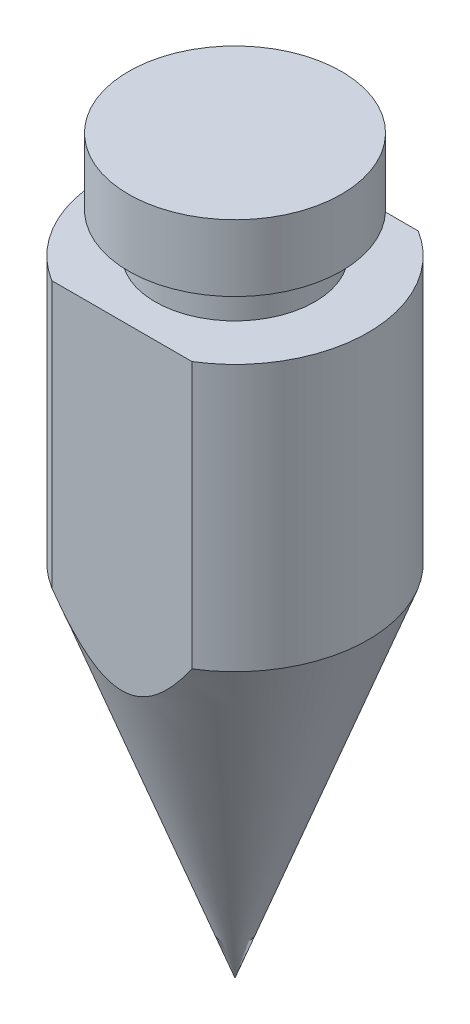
ISO-10303-21;
HEADER;
FILE_DESCRIPTION(('STEP AP214'),'2;1');
FILE_NAME('part.step','',(''),(''),'','','');
FILE_SCHEMA(('AUTOMOTIVE_DESIGN { 1 0 10303 214 1 1 1 1 }'));
ENDSEC;
DATA;
#1=APPLICATION_CONTEXT('core data for automotive mechanical design processes');
#2=APPLICATION_PROTOCOL_DEFINITION('international standard','automotive_design',2000,#1);
#3=PRODUCT_CONTEXT('',#1,'mechanical');
#4=PRODUCT('Part','Part','',(#3));
#5=PRODUCT_RELATED_PRODUCT_CATEGORY('part','',(#4));
#6=PRODUCT_DEFINITION_FORMATION('','',#4);
#7=PRODUCT_DEFINITION_CONTEXT('part definition',#1,'design');
#8=PRODUCT_DEFINITION('design','',#6,#7);
#9=PRODUCT_DEFINITION_SHAPE('','',#8);
#10=(LENGTH_UNIT() NAMED_UNIT(*) SI_UNIT(.MILLI.,.METRE.));
#11=(NAMED_UNIT(*) PLANE_ANGLE_UNIT() SI_UNIT($,.RADIAN.));
#12=(NAMED_UNIT(*) SI_UNIT($,.STERADIAN.) SOLID_ANGLE_UNIT());
#13=UNCERTAINTY_MEASURE_WITH_UNIT(LENGTH_MEASURE(1.E-05),#10,'distance_accuracy_value','');
#14=(GEOMETRIC_REPRESENTATION_CONTEXT(3) GLOBAL_UNCERTAINTY_ASSIGNED_CONTEXT((#13)) GLOBAL_UNIT_ASSIGNED_CONTEXT((#10,
#11,#12)) REPRESENTATION_CONTEXT('',''));
#15=CARTESIAN_POINT('',(0.,0.,0.));
#16=DIRECTION('',(0.,0.,1.));
#17=DIRECTION('',(1.,0.,0.));
#18=AXIS2_PLACEMENT_3D('',#15,#16,#17);
#19=CARTESIAN_POINT('',(0.,0.,0.));
#20=DIRECTION('',(0.,-1.,0.));
#21=DIRECTION('',(1.,0.,0.));
#22=AXIS2_PLACEMENT_3D('',#19,#20,#21);
#23=CYLINDRICAL_SURFACE('',#22,10.);
#24=CARTESIAN_POINT('',(0.,0.,0.));
#25=DIRECTION('',(0.,-1.,0.));
#26=DIRECTION('',(1.,0.,0.));
#27=AXIS2_PLACEMENT_3D('',#24,#25,#26);
#28=CIRCLE('',#27,10.);
#29=CARTESIAN_POINT('',(5.26782687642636,0.,-8.5));
#30=VERTEX_POINT('',#29);
#31=CARTESIAN_POINT('',(5.26782687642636,0.,8.5));
#32=VERTEX_POINT('',#31);
#33=EDGE_CURVE('E58',#30,#32,#28,.T.);
#34=ORIENTED_EDGE('',*,*,#33,.F.);
#35=DIRECTION('',(0.,1.,0.));
#36=VECTOR('',#35,1.);
#37=CARTESIAN_POINT('',(5.26782687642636,-27.,-8.5));
#38=LINE('',#37,#36);
#39=CARTESIAN_POINT('',(5.26782687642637,20.,-8.5));
#40=VERTEX_POINT('',#39);
#41=EDGE_CURVE('E98',#30,#40,#38,.T.);
#42=ORIENTED_EDGE('',*,*,#41,.T.);
#43=CARTESIAN_POINT('',(0.,20.,0.));
#44=DIRECTION('',(0.,-1.,0.));
#45=DIRECTION('',(1.,0.,0.));
#46=AXIS2_PLACEMENT_3D('',#43,#44,#45);
#47=CIRCLE('',#46,10.);
#48=CARTESIAN_POINT('',(5.26782687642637,20.,8.5));
#49=VERTEX_POINT('',#48);
#50=EDGE_CURVE('E109',#40,#49,#47,.T.);
#51=ORIENTED_EDGE('',*,*,#50,.T.);
#52=DIRECTION('',(0.,1.,0.));
#53=VECTOR('',#52,1.);
#54=CARTESIAN_POINT('',(5.26782687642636,-27.,8.5));
#55=LINE('',#54,#53);
#56=EDGE_CURVE('E77',#32,#49,#55,.T.);
#57=ORIENTED_EDGE('',*,*,#56,.F.);
#58=EDGE_LOOP('',(#34,#42,#51,#57));
#59=FACE_BOUND('',#58,.T.);
#60=ADVANCED_FACE('F54',(#59),#23,.T.);
#61=CARTESIAN_POINT('',(-8.,28.,0.));
#62=DIRECTION('',(0.,-1.,0.));
#63=DIRECTION('',(1.,0.,0.));
#64=AXIS2_PLACEMENT_3D('',#61,#62,#63);
#65=PLANE('',#64);
#66=CARTESIAN_POINT('',(0.,28.,0.));
#67=DIRECTION('',(0.,-1.,0.));
#68=DIRECTION('',(1.,0.,0.));
#69=AXIS2_PLACEMENT_3D('',#66,#67,#68);
#70=CIRCLE('',#69,8.);
#71=CARTESIAN_POINT('',(8.,28.,0.));
#72=VERTEX_POINT('',#71);
#73=EDGE_CURVE('E127',#72,#72,#70,.T.);
#74=ORIENTED_EDGE('',*,*,#73,.F.);
#75=EDGE_LOOP('',(#74));
#76=FACE_BOUND('',#75,.T.);
#77=ADVANCED_FACE('F56',(#76),#65,.F.);
#78=CARTESIAN_POINT('',(0.,0.,0.));
#79=DIRECTION('',(0.,1.,0.));
#80=DIRECTION('',(-1.,0.,0.));
#81=AXIS2_PLACEMENT_3D('',#78,#79,#80);
#82=CONICAL_SURFACE('',#81,10.,0.35470565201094);
#83=CARTESIAN_POINT('',(0.,-27.,0.));
#84=VERTEX_POINT('',#83);
#85=VERTEX_LOOP('',#84);
#86=FACE_BOUND('',#85,.T.);
#87=CARTESIAN_POINT('',(-5.26782687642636,0.,8.5));
#88=VERTEX_POINT('',#87);
#89=CARTESIAN_POINT('',(-5.26782687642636,0.,-8.5));
#90=VERTEX_POINT('',#89);
#91=EDGE_CURVE('E12',#88,#90,#28,.T.);
#92=ORIENTED_EDGE('',*,*,#91,.T.);
#93=CARTESIAN_POINT('',(-21.171951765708,34.5991577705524,-8.5));
#94=CARTESIAN_POINT('',(-20.914823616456,33.9549013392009,-8.5));
#95=CARTESIAN_POINT('',(-20.6571397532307,33.3108667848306,-8.5));
#96=CARTESIAN_POINT('',(-20.1405193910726,32.0232991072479,-8.5));
#97=CARTESIAN_POINT('',(-19.8815828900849,31.3797659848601,-8.5));
#98=CARTESIAN_POINT('',(-19.1026350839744,29.4498875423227,-8.5));
#99=CARTESIAN_POINT('',(-18.5805337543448,28.1643842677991,-8.5));
#100=CARTESIAN_POINT('',(-17.527311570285,25.5915465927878,-8.5));
#101=CARTESIAN_POINT('',(-16.9961645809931,24.3042228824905,-8.5));
#102=CARTESIAN_POINT('',(-15.9246200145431,21.7335302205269,-8.5));
#103=CARTESIAN_POINT('',(-15.3842231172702,20.4501609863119,-8.5));
#104=CARTESIAN_POINT('',(-14.5555360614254,18.5087485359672,-8.5));
#105=CARTESIAN_POINT('',(-14.2718431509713,17.8487429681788,-8.5));
#106=CARTESIAN_POINT('',(-13.7004923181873,16.5304503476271,-8.5));
#107=CARTESIAN_POINT('',(-13.4128344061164,15.8721632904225,-8.5));
#108=CARTESIAN_POINT('',(-12.8327136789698,14.5575229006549,-8.5));
#109=CARTESIAN_POINT('',(-12.540249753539,13.901170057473,-8.5));
#110=CARTESIAN_POINT('',(-11.9495763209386,12.5910595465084,-8.5));
#111=CARTESIAN_POINT('',(-11.6513668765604,11.9373018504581,-8.5));
#112=CARTESIAN_POINT('',(-11.0483884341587,10.6341883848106,-8.5));
#113=CARTESIAN_POINT('',(-10.7436317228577,9.98482694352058,-8.5));
#114=CARTESIAN_POINT('',(-10.1252547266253,8.69034745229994,-8.5));
#115=CARTESIAN_POINT('',(-9.81163463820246,8.04522930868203,-8.5));
#116=CARTESIAN_POINT('',(-9.17311755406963,6.76085870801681,-8.5));
#117=CARTESIAN_POINT('',(-8.84822476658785,6.12160417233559,-8.5));
#118=CARTESIAN_POINT('',(-8.3495486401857,5.16869408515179,-8.5));
#119=CARTESIAN_POINT('',(-8.18144157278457,4.85206675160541,-8.5));
#120=CARTESIAN_POINT('',(-7.8407853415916,4.22121361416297,-8.5));
#121=CARTESIAN_POINT('',(-7.66823629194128,3.90698774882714,-8.5));
#122=CARTESIAN_POINT('',(-7.38460370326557,3.40058153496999,-8.5));
#123=CARTESIAN_POINT('',(-7.2751372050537,3.20749507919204,-8.5));
#124=CARTESIAN_POINT('',(-7.05395332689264,2.82260962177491,-8.5));
#125=CARTESIAN_POINT('',(-6.94223590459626,2.63081064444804,-8.5));
#126=CARTESIAN_POINT('',(-6.71625178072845,2.24864879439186,-8.5));
#127=CARTESIAN_POINT('',(-6.60198442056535,2.05828631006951,-8.5));
#128=CARTESIAN_POINT('',(-6.37060284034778,1.67930688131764,-8.5));
#129=CARTESIAN_POINT('',(-6.25348863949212,1.49068992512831,-8.5));
#130=CARTESIAN_POINT('',(-5.89702059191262,0.927380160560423,-8.5));
#131=CARTESIAN_POINT('',(-5.65281940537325,0.555703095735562,-8.5));
#132=CARTESIAN_POINT('',(-5.27384144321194,0.00703762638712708,-8.5));
#133=CARTESIAN_POINT('',(-5.14542289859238,-0.174349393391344,-8.5));
#134=CARTESIAN_POINT('',(-4.88363359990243,-0.533506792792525,-8.5));
#135=CARTESIAN_POINT('',(-4.75026321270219,-0.711277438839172,-8.5));
#136=CARTESIAN_POINT('',(-4.45767780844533,-1.08815807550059,-8.5));
#137=CARTESIAN_POINT('',(-4.29754664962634,-1.28656114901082,-8.5));
#138=CARTESIAN_POINT('',(-3.96796519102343,-1.67567615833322,-8.5));
#139=CARTESIAN_POINT('',(-3.79851100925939,-1.86638483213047,-8.5));
#140=CARTESIAN_POINT('',(-3.44911733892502,-2.23632097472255,-8.5));
#141=CARTESIAN_POINT('',(-3.26923171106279,-2.41559886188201,-8.5));
#142=CARTESIAN_POINT('',(-2.89588771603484,-2.75927025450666,-8.5));
#143=CARTESIAN_POINT('',(-2.70244485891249,-2.92368029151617,-8.5));
#144=CARTESIAN_POINT('',(-2.3486233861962,-3.19328490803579,-8.5));
#145=CARTESIAN_POINT('',(-2.19180447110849,-3.30310154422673,-8.5));
#146=CARTESIAN_POINT('',(-1.86756147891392,-3.50645542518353,-8.5));
#147=CARTESIAN_POINT('',(-1.70012530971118,-3.59997363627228,-8.5));
#148=CARTESIAN_POINT('',(-1.33905128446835,-3.77231610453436,-8.5));
#149=CARTESIAN_POINT('',(-1.1444050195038,-3.84911635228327,-8.5));
#150=CARTESIAN_POINT('',(-0.844952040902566,-3.93844817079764,-8.5));
#151=CARTESIAN_POINT('',(-0.743936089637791,-3.96390815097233,-8.5));
#152=CARTESIAN_POINT('',(-0.540000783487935,-4.00536819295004,-8.5));
#153=CARTESIAN_POINT('',(-0.437082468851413,-4.02137327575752,-8.5));
#154=CARTESIAN_POINT('',(-0.22927036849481,-4.04337942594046,-8.5));
#155=CARTESIAN_POINT('',(-0.124367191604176,-4.04929255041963,-8.5));
#156=CARTESIAN_POINT('',(0.0855039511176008,-4.05058751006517,-8.5));
#157=CARTESIAN_POINT('',(0.190471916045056,-4.0459694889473,-8.5));
#158=CARTESIAN_POINT('',(0.399528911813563,-4.02639551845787,-8.5));
#159=CARTESIAN_POINT('',(0.503617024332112,-4.01142986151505,-8.5));
#160=CARTESIAN_POINT('',(0.709961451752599,-3.97176328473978,-8.5));
#161=CARTESIAN_POINT('',(0.81221663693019,-3.94705656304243,-8.5));
#162=CARTESIAN_POINT('',(1.02927856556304,-3.88445302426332,-8.5));
#163=CARTESIAN_POINT('',(1.14367435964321,-3.84513585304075,-8.5));
#164=CARTESIAN_POINT('',(1.36851204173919,-3.75639675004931,-8.5));
#165=CARTESIAN_POINT('',(1.47895084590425,-3.70696713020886,-8.5));
#166=CARTESIAN_POINT('',(1.80407153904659,-3.54583890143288,-8.5));
#167=CARTESIAN_POINT('',(2.01243274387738,-3.42134014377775,-8.5));
#168=CARTESIAN_POINT('',(2.40146005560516,-3.15676352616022,-8.5));
#169=CARTESIAN_POINT('',(2.58302504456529,-3.01795801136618,-8.5));
#170=CARTESIAN_POINT('',(2.93394208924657,-2.7254860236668,-8.5));
#171=CARTESIAN_POINT('',(3.10328178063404,-2.57180486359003,-8.5));
#172=CARTESIAN_POINT('',(3.43213589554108,-2.25322004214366,-8.5));
#173=CARTESIAN_POINT('',(3.59161212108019,-2.08827739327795,-8.5));
#174=CARTESIAN_POINT('',(3.82422254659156,-1.83494631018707,-8.5));
#175=CARTESIAN_POINT('',(3.90064250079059,-1.74953601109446,-8.5));
#176=CARTESIAN_POINT('',(4.0514857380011,-1.57697048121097,-8.5));
#177=CARTESIAN_POINT('',(4.12590904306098,-1.48981526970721,-8.5));
#178=CARTESIAN_POINT('',(4.35018710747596,-1.22159863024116,-8.5));
#179=CARTESIAN_POINT('',(4.49712751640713,-1.03809669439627,-8.5));
#180=CARTESIAN_POINT('',(4.78460795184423,-0.666129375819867,-8.5));
#181=CARTESIAN_POINT('',(4.92514683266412,-0.477663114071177,-8.5));
#182=CARTESIAN_POINT('',(5.20087328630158,-0.0966922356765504,-8.5));
#183=CARTESIAN_POINT('',(5.3360575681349,0.0958147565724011,-8.5));
#184=CARTESIAN_POINT('',(5.60177699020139,0.484017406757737,-8.5));
#185=CARTESIAN_POINT('',(5.73231182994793,0.679713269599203,-8.5));
#186=CARTESIAN_POINT('',(6.11850606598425,1.27158396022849,-8.5));
#187=CARTESIAN_POINT('',(6.36814666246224,1.67168708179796,-8.5));
#188=CARTESIAN_POINT('',(6.85526470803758,2.47923083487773,-8.5));
#189=CARTESIAN_POINT('',(7.09274063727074,2.88667237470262,-8.5));
#190=CARTESIAN_POINT('',(7.44275676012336,3.50364047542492,-8.5));
#191=CARTESIAN_POINT('',(7.55887158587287,3.71115051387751,-8.5));
#192=CARTESIAN_POINT('',(7.78891042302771,4.12736230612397,-8.5));
#193=CARTESIAN_POINT('',(7.90283458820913,4.33606397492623,-8.5));
#194=CARTESIAN_POINT('',(8.24170666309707,4.96378814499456,-8.5));
#195=CARTESIAN_POINT('',(8.4637315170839,5.3843896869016,-8.5));
#196=CARTESIAN_POINT('',(8.90106757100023,6.22817955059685,-8.5));
#197=CARTESIAN_POINT('',(9.11638920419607,6.65136248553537,-8.5));
#198=CARTESIAN_POINT('',(9.54176951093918,7.5003433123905,-8.5));
#199=CARTESIAN_POINT('',(9.75182836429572,7.92614111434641,-8.5));
#200=CARTESIAN_POINT('',(10.1709020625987,8.78681161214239,-8.5));
#201=CARTESIAN_POINT('',(10.3798446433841,9.22171944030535,-8.5));
#202=CARTESIAN_POINT('',(10.7938551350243,10.0933768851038,-8.5));
#203=CARTESIAN_POINT('',(10.9989230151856,10.5301265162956,-8.5));
#204=CARTESIAN_POINT('',(11.6091837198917,11.8427102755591,-8.5));
#205=CARTESIAN_POINT('',(12.00941929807,12.7208496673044,-8.5));
#206=CARTESIAN_POINT('',(12.799995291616,14.4817144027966,-8.5));
#207=CARTESIAN_POINT('',(13.1903341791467,15.3644404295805,-8.5));
#208=CARTESIAN_POINT('',(13.9632611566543,17.1332839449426,-8.5));
#209=CARTESIAN_POINT('',(14.3458491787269,18.0194014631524,-8.5));
#210=CARTESIAN_POINT('',(15.1053749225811,19.7954711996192,-8.5));
#211=CARTESIAN_POINT('',(15.4823042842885,20.6854269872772,-8.5));
#212=CARTESIAN_POINT('',(16.2311558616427,22.4674448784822,-8.5));
#213=CARTESIAN_POINT('',(16.6030780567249,23.3595069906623,-8.5));
#214=CARTESIAN_POINT('',(17.3427669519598,25.1452522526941,-8.5));
#215=CARTESIAN_POINT('',(17.7105340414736,26.0389352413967,-8.5));
#216=CARTESIAN_POINT('',(18.4426284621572,27.8277090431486,-8.5));
#217=CARTESIAN_POINT('',(18.8069557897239,28.7227998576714,-8.5));
#218=CARTESIAN_POINT('',(19.8472737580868,31.2905288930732,-8.5));
#219=CARTESIAN_POINT('',(20.5196774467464,32.9646203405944,-8.5));
#220=CARTESIAN_POINT('',(21.8570075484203,36.3158372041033,-8.5));
#221=CARTESIAN_POINT('',(22.5219337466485,37.9929627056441,-8.5));
#222=CARTESIAN_POINT('',(23.8446261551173,41.3459810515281,-8.5));
#223=CARTESIAN_POINT('',(24.5024044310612,43.0218691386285,-8.5));
#224=CARTESIAN_POINT('',(25.4856620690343,45.5369974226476,-8.5));
#225=CARTESIAN_POINT('',(25.8128403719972,46.3755742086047,-8.5));
#226=CARTESIAN_POINT('',(26.4661784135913,48.0531238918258,-8.5));
#227=CARTESIAN_POINT('',(26.7923381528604,48.8920967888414,-8.5));
#228=CARTESIAN_POINT('',(27.1180457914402,49.7312452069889,-8.5));
#229=B_SPLINE_CURVE_WITH_KNOTS('',3,(#93,#94,#95,#96,#97,#98,#99,#100,#101,#102,#103,#104,#105,
#106,#107,#108,#109,#110,#111,#112,#113,#114,#115,#116,#117,#118,#119,#120,#121,#122,#123,#124,
#125,#126,#127,#128,#129,#130,#131,#132,#133,#134,#135,#136,#137,#138,#139,#140,#141,#142,#143,
#144,#145,#146,#147,#148,#149,#150,#151,#152,#153,#154,#155,#156,#157,#158,#159,#160,#161,#162,
#163,#164,#165,#166,#167,#168,#169,#170,#171,#172,#173,#174,#175,#176,#177,#178,#179,#180,#181,
#182,#183,#184,#185,#186,#187,#188,#189,#190,#191,#192,#193,#194,#195,#196,#197,#198,#199,#200,
#201,#202,#203,#204,#205,#206,#207,#208,#209,#210,#211,#212,#213,#214,#215,#216,#217,#218,#219,
#220,#221,#222,#223,#224,#225,#226,#227,#228),.UNSPECIFIED.,.F.,.F.,(4,2,2,2,2,2,2,2,2,2,2,2,2,
2,2,2,2,2,2,2,2,2,2,2,2,2,2,2,2,2,2,2,2,2,2,2,2,2,2,2,2,2,2,2,2,2,2,2,2,2,2,2,2,2,2,2,2,2,2,2,2,
2,2,2,2,2,2,4),(0.,2.08101626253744,4.16203593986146,8.32446645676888,12.5022255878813,
16.6796789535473,18.8348488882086,20.9900132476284,23.1456827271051,25.3013286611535,
27.4532322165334,29.6050880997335,31.7561491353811,32.8315831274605,33.9069895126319,
34.5728503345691,35.238723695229,35.9047710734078,36.5708139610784,37.9045494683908,
38.5712179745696,39.2378371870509,40.002500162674,40.7674839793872,41.528819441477,
42.2892976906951,42.8628561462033,43.4370799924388,44.0619596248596,44.3741077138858,
44.6860898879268,45.0007770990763,45.3154600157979,45.6304385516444,45.9456049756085,
46.3079233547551,46.6705182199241,47.3960960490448,48.0808086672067,48.7662043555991,
49.4541066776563,49.7979055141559,50.1417005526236,50.8467594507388,51.5519440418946,
52.2575555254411,52.9632125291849,54.377671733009,55.7923072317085,56.5056594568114,
57.2189614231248,58.6457035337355,60.0701010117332,61.4944497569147,62.9419134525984,
64.3893886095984,67.2844375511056,70.179930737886,73.0754492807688,75.9748918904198,
78.8743464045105,81.7735269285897,84.6727104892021,90.0849263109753,95.4972972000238,
100.898349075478,103.598776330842,106.299201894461),.UNSPECIFIED.);
#230=EDGE_CURVE('E130',#90,#30,#229,.T.);
#231=ORIENTED_EDGE('',*,*,#230,.T.);
#232=ORIENTED_EDGE('',*,*,#33,.T.);
#233=CARTESIAN_POINT('',(-21.171951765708,34.5991577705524,8.5));
#234=CARTESIAN_POINT('',(-20.914823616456,33.9549013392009,8.5));
#235=CARTESIAN_POINT('',(-20.6571397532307,33.3108667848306,8.5));
#236=CARTESIAN_POINT('',(-20.1405193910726,32.0232991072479,8.5));
#237=CARTESIAN_POINT('',(-19.8815828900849,31.3797659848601,8.5));
#238=CARTESIAN_POINT('',(-19.1026350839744,29.4498875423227,8.5));
#239=CARTESIAN_POINT('',(-18.5805337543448,28.1643842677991,8.5));
#240=CARTESIAN_POINT('',(-17.527311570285,25.5915465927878,8.5));
#241=CARTESIAN_POINT('',(-16.9961645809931,24.3042228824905,8.5));
#242=CARTESIAN_POINT('',(-15.9246200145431,21.7335302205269,8.5));
#243=CARTESIAN_POINT('',(-15.3842231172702,20.4501609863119,8.5));
#244=CARTESIAN_POINT('',(-14.5555360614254,18.5087485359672,8.5));
#245=CARTESIAN_POINT('',(-14.2718431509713,17.8487429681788,8.5));
#246=CARTESIAN_POINT('',(-13.7004923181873,16.5304503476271,8.5));
#247=CARTESIAN_POINT('',(-13.4128344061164,15.8721632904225,8.5));
#248=CARTESIAN_POINT('',(-12.8327136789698,14.5575229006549,8.5));
#249=CARTESIAN_POINT('',(-12.540249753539,13.901170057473,8.5));
#250=CARTESIAN_POINT('',(-11.9495763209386,12.5910595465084,8.5));
#251=CARTESIAN_POINT('',(-11.6513668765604,11.9373018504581,8.5));
#252=CARTESIAN_POINT('',(-11.0483884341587,10.6341883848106,8.5));
#253=CARTESIAN_POINT('',(-10.7436317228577,9.98482694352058,8.5));
#254=CARTESIAN_POINT('',(-10.1252547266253,8.69034745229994,8.5));
#255=CARTESIAN_POINT('',(-9.81163463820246,8.04522930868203,8.5));
#256=CARTESIAN_POINT('',(-9.17311755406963,6.76085870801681,8.5));
#257=CARTESIAN_POINT('',(-8.84822476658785,6.12160417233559,8.5));
#258=CARTESIAN_POINT('',(-8.3495486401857,5.16869408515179,8.5));
#259=CARTESIAN_POINT('',(-8.18144157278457,4.85206675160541,8.5));
#260=CARTESIAN_POINT('',(-7.8407853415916,4.22121361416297,8.5));
#261=CARTESIAN_POINT('',(-7.66823629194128,3.90698774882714,8.5));
#262=CARTESIAN_POINT('',(-7.38460370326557,3.40058153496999,8.5));
#263=CARTESIAN_POINT('',(-7.2751372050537,3.20749507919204,8.5));
#264=CARTESIAN_POINT('',(-7.05395332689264,2.82260962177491,8.5));
#265=CARTESIAN_POINT('',(-6.94223590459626,2.63081064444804,8.5));
#266=CARTESIAN_POINT('',(-6.71625178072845,2.24864879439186,8.5));
#267=CARTESIAN_POINT('',(-6.60198442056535,2.05828631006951,8.5));
#268=CARTESIAN_POINT('',(-6.37060284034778,1.67930688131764,8.5));
#269=CARTESIAN_POINT('',(-6.25348863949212,1.49068992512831,8.5));
#270=CARTESIAN_POINT('',(-5.89702059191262,0.927380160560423,8.5));
#271=CARTESIAN_POINT('',(-5.65281940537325,0.555703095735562,8.5));
#272=CARTESIAN_POINT('',(-5.27384144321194,0.00703762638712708,8.5));
#273=CARTESIAN_POINT('',(-5.14542289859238,-0.174349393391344,8.5));
#274=CARTESIAN_POINT('',(-4.88363359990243,-0.533506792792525,8.5));
#275=CARTESIAN_POINT('',(-4.75026321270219,-0.711277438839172,8.5));
#276=CARTESIAN_POINT('',(-4.45767780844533,-1.08815807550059,8.5));
#277=CARTESIAN_POINT('',(-4.29754664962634,-1.28656114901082,8.5));
#278=CARTESIAN_POINT('',(-3.96796519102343,-1.67567615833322,8.5));
#279=CARTESIAN_POINT('',(-3.79851100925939,-1.86638483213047,8.5));
#280=CARTESIAN_POINT('',(-3.44911733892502,-2.23632097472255,8.5));
#281=CARTESIAN_POINT('',(-3.26923171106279,-2.41559886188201,8.5));
#282=CARTESIAN_POINT('',(-2.89588771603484,-2.75927025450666,8.5));
#283=CARTESIAN_POINT('',(-2.70244485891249,-2.92368029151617,8.5));
#284=CARTESIAN_POINT('',(-2.3486233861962,-3.19328490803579,8.5));
#285=CARTESIAN_POINT('',(-2.19180447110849,-3.30310154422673,8.5));
#286=CARTESIAN_POINT('',(-1.86756147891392,-3.50645542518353,8.5));
#287=CARTESIAN_POINT('',(-1.70012530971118,-3.59997363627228,8.5));
#288=CARTESIAN_POINT('',(-1.33905128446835,-3.77231610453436,8.5));
#289=CARTESIAN_POINT('',(-1.1444050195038,-3.84911635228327,8.5));
#290=CARTESIAN_POINT('',(-0.844952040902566,-3.93844817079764,8.5));
#291=CARTESIAN_POINT('',(-0.743936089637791,-3.96390815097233,8.5));
#292=CARTESIAN_POINT('',(-0.540000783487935,-4.00536819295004,8.5));
#293=CARTESIAN_POINT('',(-0.437082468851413,-4.02137327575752,8.5));
#294=CARTESIAN_POINT('',(-0.22927036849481,-4.04337942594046,8.5));
#295=CARTESIAN_POINT('',(-0.124367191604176,-4.04929255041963,8.5));
#296=CARTESIAN_POINT('',(0.0855039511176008,-4.05058751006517,8.5));
#297=CARTESIAN_POINT('',(0.190471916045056,-4.0459694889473,8.5));
#298=CARTESIAN_POINT('',(0.399528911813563,-4.02639551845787,8.5));
#299=CARTESIAN_POINT('',(0.503617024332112,-4.01142986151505,8.5));
#300=CARTESIAN_POINT('',(0.709961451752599,-3.97176328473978,8.5));
#301=CARTESIAN_POINT('',(0.81221663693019,-3.94705656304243,8.5));
#302=CARTESIAN_POINT('',(1.02927856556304,-3.88445302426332,8.5));
#303=CARTESIAN_POINT('',(1.14367435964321,-3.84513585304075,8.5));
#304=CARTESIAN_POINT('',(1.36851204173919,-3.75639675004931,8.5));
#305=CARTESIAN_POINT('',(1.47895084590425,-3.70696713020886,8.5));
#306=CARTESIAN_POINT('',(1.80407153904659,-3.54583890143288,8.5));
#307=CARTESIAN_POINT('',(2.01243274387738,-3.42134014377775,8.5));
#308=CARTESIAN_POINT('',(2.40146005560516,-3.15676352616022,8.5));
#309=CARTESIAN_POINT('',(2.58302504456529,-3.01795801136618,8.5));
#310=CARTESIAN_POINT('',(2.93394208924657,-2.7254860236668,8.5));
#311=CARTESIAN_POINT('',(3.10328178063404,-2.57180486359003,8.5));
#312=CARTESIAN_POINT('',(3.43213589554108,-2.25322004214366,8.5));
#313=CARTESIAN_POINT('',(3.59161212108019,-2.08827739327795,8.5));
#314=CARTESIAN_POINT('',(3.82422254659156,-1.83494631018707,8.5));
#315=CARTESIAN_POINT('',(3.90064250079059,-1.74953601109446,8.5));
#316=CARTESIAN_POINT('',(4.0514857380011,-1.57697048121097,8.5));
#317=CARTESIAN_POINT('',(4.12590904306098,-1.48981526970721,8.5));
#318=CARTESIAN_POINT('',(4.35018710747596,-1.22159863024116,8.5));
#319=CARTESIAN_POINT('',(4.49712751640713,-1.03809669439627,8.5));
#320=CARTESIAN_POINT('',(4.78460795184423,-0.666129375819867,8.5));
#321=CARTESIAN_POINT('',(4.92514683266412,-0.477663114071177,8.5));
#322=CARTESIAN_POINT('',(5.20087328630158,-0.0966922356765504,8.5));
#323=CARTESIAN_POINT('',(5.3360575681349,0.0958147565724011,8.5));
#324=CARTESIAN_POINT('',(5.60177699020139,0.484017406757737,8.5));
#325=CARTESIAN_POINT('',(5.73231182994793,0.679713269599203,8.5));
#326=CARTESIAN_POINT('',(6.11850606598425,1.27158396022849,8.5));
#327=CARTESIAN_POINT('',(6.36814666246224,1.67168708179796,8.5));
#328=CARTESIAN_POINT('',(6.85526470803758,2.47923083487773,8.5));
#329=CARTESIAN_POINT('',(7.09274063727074,2.88667237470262,8.5));
#330=CARTESIAN_POINT('',(7.44275676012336,3.50364047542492,8.5));
#331=CARTESIAN_POINT('',(7.55887158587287,3.71115051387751,8.5));
#332=CARTESIAN_POINT('',(7.78891042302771,4.12736230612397,8.5));
#333=CARTESIAN_POINT('',(7.90283458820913,4.33606397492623,8.5));
#334=CARTESIAN_POINT('',(8.24170666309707,4.96378814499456,8.5));
#335=CARTESIAN_POINT('',(8.4637315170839,5.3843896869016,8.5));
#336=CARTESIAN_POINT('',(8.90106757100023,6.22817955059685,8.5));
#337=CARTESIAN_POINT('',(9.11638920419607,6.65136248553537,8.5));
#338=CARTESIAN_POINT('',(9.54176951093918,7.5003433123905,8.5));
#339=CARTESIAN_POINT('',(9.75182836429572,7.92614111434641,8.5));
#340=CARTESIAN_POINT('',(10.1709020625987,8.78681161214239,8.5));
#341=CARTESIAN_POINT('',(10.3798446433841,9.22171944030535,8.5));
#342=CARTESIAN_POINT('',(10.7938551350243,10.0933768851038,8.5));
#343=CARTESIAN_POINT('',(10.9989230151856,10.5301265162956,8.5));
#344=CARTESIAN_POINT('',(11.6091837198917,11.8427102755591,8.5));
#345=CARTESIAN_POINT('',(12.00941929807,12.7208496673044,8.5));
#346=CARTESIAN_POINT('',(12.799995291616,14.4817144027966,8.5));
#347=CARTESIAN_POINT('',(13.1903341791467,15.3644404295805,8.5));
#348=CARTESIAN_POINT('',(13.9632611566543,17.1332839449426,8.5));
#349=CARTESIAN_POINT('',(14.3458491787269,18.0194014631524,8.5));
#350=CARTESIAN_POINT('',(15.1053749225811,19.7954711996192,8.5));
#351=CARTESIAN_POINT('',(15.4823042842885,20.6854269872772,8.5));
#352=CARTESIAN_POINT('',(16.2311558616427,22.4674448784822,8.5));
#353=CARTESIAN_POINT('',(16.6030780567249,23.3595069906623,8.5));
#354=CARTESIAN_POINT('',(17.3427669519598,25.1452522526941,8.5));
#355=CARTESIAN_POINT('',(17.7105340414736,26.0389352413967,8.5));
#356=CARTESIAN_POINT('',(18.4426284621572,27.8277090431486,8.5));
#357=CARTESIAN_POINT('',(18.8069557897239,28.7227998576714,8.5));
#358=CARTESIAN_POINT('',(19.8472737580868,31.2905288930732,8.5));
#359=CARTESIAN_POINT('',(20.5196774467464,32.9646203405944,8.5));
#360=CARTESIAN_POINT('',(21.8570075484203,36.3158372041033,8.5));
#361=CARTESIAN_POINT('',(22.5219337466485,37.9929627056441,8.5));
#362=CARTESIAN_POINT('',(23.8446261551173,41.3459810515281,8.5));
#363=CARTESIAN_POINT('',(24.5024044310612,43.0218691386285,8.5));
#364=CARTESIAN_POINT('',(25.4856620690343,45.5369974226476,8.5));
#365=CARTESIAN_POINT('',(25.8128403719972,46.3755742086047,8.5));
#366=CARTESIAN_POINT('',(26.4661784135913,48.0531238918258,8.5));
#367=CARTESIAN_POINT('',(26.7923381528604,48.8920967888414,8.5));
#368=CARTESIAN_POINT('',(27.1180457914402,49.7312452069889,8.5));
#369=B_SPLINE_CURVE_WITH_KNOTS('',3,(#233,#234,#235,#236,#237,#238,#239,#240,#241,#242,#243,
#244,#245,#246,#247,#248,#249,#250,#251,#252,#253,#254,#255,#256,#257,#258,#259,#260,#261,#262,
#263,#264,#265,#266,#267,#268,#269,#270,#271,#272,#273,#274,#275,#276,#277,#278,#279,#280,#281,
#282,#283,#284,#285,#286,#287,#288,#289,#290,#291,#292,#293,#294,#295,#296,#297,#298,#299,#300,
#301,#302,#303,#304,#305,#306,#307,#308,#309,#310,#311,#312,#313,#314,#315,#316,#317,#318,#319,
#320,#321,#322,#323,#324,#325,#326,#327,#328,#329,#330,#331,#332,#333,#334,#335,#336,#337,#338,
#339,#340,#341,#342,#343,#344,#345,#346,#347,#348,#349,#350,#351,#352,#353,#354,#355,#356,#357,
#358,#359,#360,#361,#362,#363,#364,#365,#366,#367,#368),.UNSPECIFIED.,.F.,.F.,(4,2,2,2,2,2,2,2,
2,2,2,2,2,2,2,2,2,2,2,2,2,2,2,2,2,2,2,2,2,2,2,2,2,2,2,2,2,2,2,2,2,2,2,2,2,2,2,2,2,2,2,2,2,2,2,2,
2,2,2,2,2,2,2,2,2,2,2,4),(0.,2.08101626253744,4.16203593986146,8.32446645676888,
12.5022255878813,16.6796789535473,18.8348488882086,20.9900132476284,23.1456827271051,
25.3013286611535,27.4532322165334,29.6050880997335,31.7561491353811,32.8315831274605,
33.9069895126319,34.5728503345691,35.238723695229,35.9047710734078,36.5708139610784,
37.9045494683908,38.5712179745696,39.2378371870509,40.002500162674,40.7674839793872,
41.528819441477,42.2892976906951,42.8628561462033,43.4370799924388,44.0619596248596,
44.3741077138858,44.6860898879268,45.0007770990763,45.3154600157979,45.6304385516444,
45.9456049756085,46.3079233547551,46.6705182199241,47.3960960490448,48.0808086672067,
48.7662043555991,49.4541066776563,49.7979055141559,50.1417005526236,50.8467594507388,
51.5519440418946,52.2575555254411,52.9632125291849,54.377671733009,55.7923072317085,
56.5056594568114,57.2189614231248,58.6457035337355,60.0701010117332,61.4944497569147,
62.9419134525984,64.3893886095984,67.2844375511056,70.179930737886,73.0754492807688,
75.9748918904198,78.8743464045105,81.7735269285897,84.6727104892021,90.0849263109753,
95.4972972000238,100.898349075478,103.598776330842,106.299201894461),.UNSPECIFIED.);
#370=EDGE_CURVE('E111',#32,#88,#369,.F.);
#371=ORIENTED_EDGE('',*,*,#370,.T.);
#372=EDGE_LOOP('',(#92,#231,#232,#371));
#373=FACE_BOUND('',#372,.T.);
#374=ADVANCED_FACE('F143',(#86,#373),#82,.T.);
#375=CARTESIAN_POINT('',(-5.26782687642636,20.,8.5));
#376=VERTEX_POINT('',#375);
#377=CARTESIAN_POINT('',(-5.26782687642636,20.,-8.5));
#378=VERTEX_POINT('',#377);
#379=EDGE_CURVE('E116',#376,#378,#47,.T.);
#380=ORIENTED_EDGE('',*,*,#379,.T.);
#381=DIRECTION('',(0.,1.,0.));
#382=VECTOR('',#381,1.);
#383=CARTESIAN_POINT('',(-5.26782687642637,-27.,-8.5));
#384=LINE('',#383,#382);
#385=EDGE_CURVE('E69',#90,#378,#384,.T.);
#386=ORIENTED_EDGE('',*,*,#385,.F.);
#387=ORIENTED_EDGE('',*,*,#91,.F.);
#388=DIRECTION('',(0.,1.,0.));
#389=VECTOR('',#388,1.);
#390=CARTESIAN_POINT('',(-5.26782687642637,-27.,8.5));
#391=LINE('',#390,#389);
#392=EDGE_CURVE('E104',#88,#376,#391,.T.);
#393=ORIENTED_EDGE('',*,*,#392,.T.);
#394=EDGE_LOOP('',(#380,#386,#387,#393));
#395=FACE_BOUND('',#394,.T.);
#396=ADVANCED_FACE('F165',(#395),#23,.T.);
#397=CARTESIAN_POINT('',(-6.,20.,0.));
#398=DIRECTION('',(0.,-1.,0.));
#399=DIRECTION('',(1.,0.,0.));
#400=AXIS2_PLACEMENT_3D('',#397,#398,#399);
#401=PLANE('',#400);
#402=ORIENTED_EDGE('',*,*,#50,.F.);
#403=DIRECTION('',(1.,0.,0.));
#404=VECTOR('',#403,1.);
#405=CARTESIAN_POINT('',(-5.26782687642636,20.,-8.5));
#406=LINE('',#405,#404);
#407=EDGE_CURVE('E95',#378,#40,#406,.T.);
#408=ORIENTED_EDGE('',*,*,#407,.F.);
#409=ORIENTED_EDGE('',*,*,#379,.F.);
#410=DIRECTION('',(-1.,0.,0.));
#411=VECTOR('',#410,1.);
#412=CARTESIAN_POINT('',(-5.26782687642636,20.,8.5));
#413=LINE('',#412,#411);
#414=EDGE_CURVE('E115',#49,#376,#413,.T.);
#415=ORIENTED_EDGE('',*,*,#414,.F.);
#416=EDGE_LOOP('',(#402,#408,#409,#415));
#417=FACE_BOUND('',#416,.T.);
#418=CARTESIAN_POINT('',(0.,20.,0.));
#419=DIRECTION('',(0.,-1.,0.));
#420=DIRECTION('',(1.,0.,0.));
#421=AXIS2_PLACEMENT_3D('',#418,#419,#420);
#422=CIRCLE('',#421,6.);
#423=CARTESIAN_POINT('',(6.,20.,0.));
#424=VERTEX_POINT('',#423);
#425=EDGE_CURVE('E117',#424,#424,#422,.T.);
#426=ORIENTED_EDGE('',*,*,#425,.T.);
#427=EDGE_LOOP('',(#426));
#428=FACE_BOUND('',#427,.T.);
#429=ADVANCED_FACE('F113',(#417,#428),#401,.F.);
#430=CARTESIAN_POINT('',(0.,0.,0.));
#431=DIRECTION('',(0.,-1.,0.));
#432=DIRECTION('',(1.,0.,0.));
#433=AXIS2_PLACEMENT_3D('',#430,#431,#432);
#434=CYLINDRICAL_SURFACE('',#433,6.);
#435=ORIENTED_EDGE('',*,*,#425,.F.);
#436=EDGE_LOOP('',(#435));
#437=FACE_BOUND('',#436,.T.);
#438=CARTESIAN_POINT('',(0.,23.,0.));
#439=DIRECTION('',(0.,-1.,0.));
#440=DIRECTION('',(1.,0.,0.));
#441=AXIS2_PLACEMENT_3D('',#438,#439,#440);
#442=CIRCLE('',#441,6.);
#443=CARTESIAN_POINT('',(6.,23.,0.));
#444=VERTEX_POINT('',#443);
#445=EDGE_CURVE('E119',#444,#444,#442,.T.);
#446=ORIENTED_EDGE('',*,*,#445,.T.);
#447=EDGE_LOOP('',(#446));
#448=FACE_BOUND('',#447,.T.);
#449=ADVANCED_FACE('F159',(#437,#448),#434,.T.);
#450=CARTESIAN_POINT('',(-8.,23.,0.));
#451=DIRECTION('',(0.,1.,0.));
#452=DIRECTION('',(-1.,0.,0.));
#453=AXIS2_PLACEMENT_3D('',#450,#451,#452);
#454=PLANE('',#453);
#455=ORIENTED_EDGE('',*,*,#445,.F.);
#456=EDGE_LOOP('',(#455));
#457=FACE_BOUND('',#456,.T.);
#458=CARTESIAN_POINT('',(0.,23.,0.));
#459=DIRECTION('',(0.,-1.,0.));
#460=DIRECTION('',(1.,0.,0.));
#461=AXIS2_PLACEMENT_3D('',#458,#459,#460);
#462=CIRCLE('',#461,8.);
#463=CARTESIAN_POINT('',(8.,23.,0.));
#464=VERTEX_POINT('',#463);
#465=EDGE_CURVE('E124',#464,#464,#462,.T.);
#466=ORIENTED_EDGE('',*,*,#465,.T.);
#467=EDGE_LOOP('',(#466));
#468=FACE_BOUND('',#467,.T.);
#469=ADVANCED_FACE('F155',(#457,#468),#454,.F.);
#470=CARTESIAN_POINT('',(0.,0.,0.));
#471=DIRECTION('',(0.,-1.,0.));
#472=DIRECTION('',(1.,0.,0.));
#473=AXIS2_PLACEMENT_3D('',#470,#471,#472);
#474=CYLINDRICAL_SURFACE('',#473,8.);
#475=ORIENTED_EDGE('',*,*,#465,.F.);
#476=EDGE_LOOP('',(#475));
#477=FACE_BOUND('',#476,.T.);
#478=ORIENTED_EDGE('',*,*,#73,.T.);
#479=EDGE_LOOP('',(#478));
#480=FACE_BOUND('',#479,.T.);
#481=ADVANCED_FACE('F152',(#477,#480),#474,.T.);
#482=CARTESIAN_POINT('',(-5.26782687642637,-27.,8.5));
#483=DIRECTION('',(0.,0.,-1.));
#484=DIRECTION('',(-1.,0.,0.));
#485=AXIS2_PLACEMENT_3D('',#482,#483,#484);
#486=PLANE('',#485);
#487=ORIENTED_EDGE('',*,*,#56,.T.);
#488=ORIENTED_EDGE('',*,*,#414,.T.);
#489=ORIENTED_EDGE('',*,*,#392,.F.);
#490=ORIENTED_EDGE('',*,*,#370,.F.);
#491=EDGE_LOOP('',(#487,#488,#489,#490));
#492=FACE_BOUND('',#491,.T.);
#493=ADVANCED_FACE('F148',(#492),#486,.F.);
#494=CARTESIAN_POINT('',(-5.26782687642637,-27.,-8.5));
#495=DIRECTION('',(0.,0.,1.));
#496=DIRECTION('',(1.,0.,0.));
#497=AXIS2_PLACEMENT_3D('',#494,#495,#496);
#498=PLANE('',#497);
#499=ORIENTED_EDGE('',*,*,#385,.T.);
#500=ORIENTED_EDGE('',*,*,#407,.T.);
#501=ORIENTED_EDGE('',*,*,#41,.F.);
#502=ORIENTED_EDGE('',*,*,#230,.F.);
#503=EDGE_LOOP('',(#499,#500,#501,#502));
#504=FACE_BOUND('',#503,.T.);
#505=ADVANCED_FACE('F97',(#504),#498,.F.);
#506=CLOSED_SHELL('',(#60,#77,#374,#396,#429,#449,#469,#481,#493,#505));
#507=MANIFOLD_SOLID_BREP('B2',#506);
#508=ADVANCED_BREP_SHAPE_REPRESENTATION('',(#18,#507),#14);
#509=SHAPE_DEFINITION_REPRESENTATION(#9,#508);
ENDSEC;
END-ISO-10303-21;
